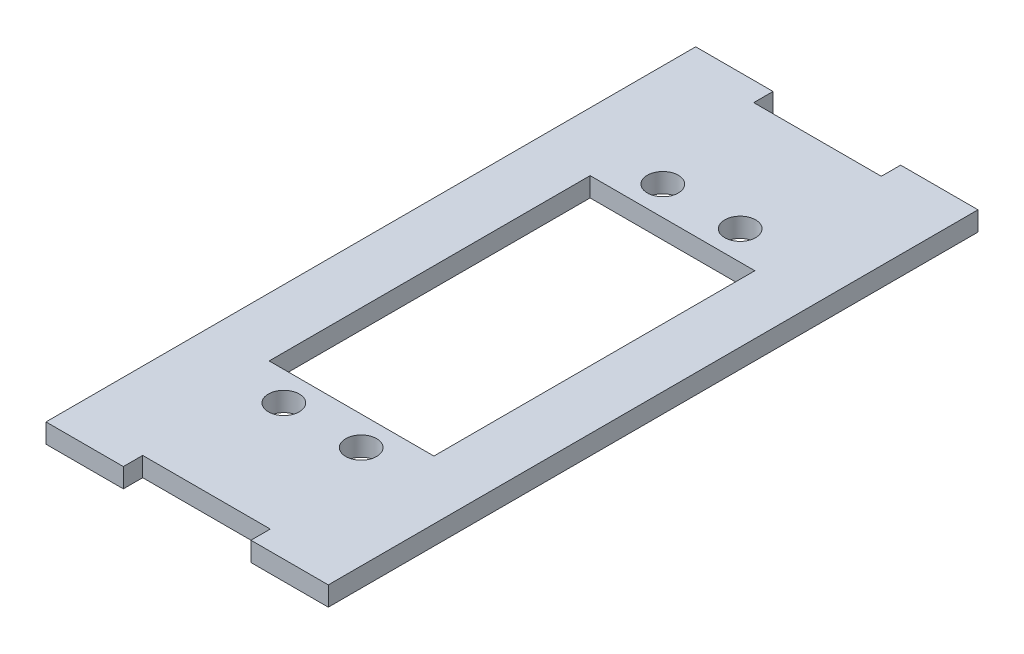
ISO-10303-21;
HEADER;
FILE_DESCRIPTION(('STEP AP214'),'2;1');
FILE_NAME('part.step','',(''),(''),'','','');
FILE_SCHEMA(('AUTOMOTIVE_DESIGN { 1 0 10303 214 1 1 1 1 }'));
ENDSEC;
DATA;
#1=APPLICATION_CONTEXT('core data for automotive mechanical design processes');
#2=APPLICATION_PROTOCOL_DEFINITION('international standard','automotive_design',2000,#1);
#3=PRODUCT_CONTEXT('',#1,'mechanical');
#4=PRODUCT('Part','Part','',(#3));
#5=PRODUCT_RELATED_PRODUCT_CATEGORY('part','',(#4));
#6=PRODUCT_DEFINITION_FORMATION('','',#4);
#7=PRODUCT_DEFINITION_CONTEXT('part definition',#1,'design');
#8=PRODUCT_DEFINITION('design','',#6,#7);
#9=PRODUCT_DEFINITION_SHAPE('','',#8);
#10=(LENGTH_UNIT() NAMED_UNIT(*) SI_UNIT(.MILLI.,.METRE.));
#11=(NAMED_UNIT(*) PLANE_ANGLE_UNIT() SI_UNIT($,.RADIAN.));
#12=(NAMED_UNIT(*) SI_UNIT($,.STERADIAN.) SOLID_ANGLE_UNIT());
#13=UNCERTAINTY_MEASURE_WITH_UNIT(LENGTH_MEASURE(1.E-05),#10,'distance_accuracy_value','');
#14=(GEOMETRIC_REPRESENTATION_CONTEXT(3) GLOBAL_UNCERTAINTY_ASSIGNED_CONTEXT((#13)) GLOBAL_UNIT_ASSIGNED_CONTEXT((#10,
#11,#12)) REPRESENTATION_CONTEXT('',''));
#15=CARTESIAN_POINT('',(0.,0.,0.));
#16=DIRECTION('',(0.,0.,1.));
#17=DIRECTION('',(1.,0.,0.));
#18=AXIS2_PLACEMENT_3D('',#15,#16,#17);
#19=CARTESIAN_POINT('',(0.,-2.5,0.));
#20=DIRECTION('',(0.,-1.,0.));
#21=DIRECTION('',(0.,0.,-1.));
#22=AXIS2_PLACEMENT_3D('',#19,#20,#21);
#23=PLANE('',#22);
#24=CARTESIAN_POINT('',(-5.,-2.50000000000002,34.5));
#25=DIRECTION('',(0.,-1.,0.));
#26=DIRECTION('',(0.,0.,-1.));
#27=AXIS2_PLACEMENT_3D('',#24,#25,#26);
#28=CIRCLE('',#27,2.0000000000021);
#29=CARTESIAN_POINT('',(-5.,-2.50000000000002,32.4999999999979));
#30=VERTEX_POINT('',#29);
#31=EDGE_CURVE('E570',#30,#30,#28,.T.);
#32=ORIENTED_EDGE('',*,*,#31,.F.);
#33=EDGE_LOOP('',(#32));
#34=FACE_BOUND('',#33,.T.);
#35=CARTESIAN_POINT('',(5.,-2.49999999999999,-14.5));
#36=DIRECTION('',(0.,-1.,0.));
#37=DIRECTION('',(0.,0.,-1.));
#38=AXIS2_PLACEMENT_3D('',#35,#36,#37);
#39=CIRCLE('',#38,2.);
#40=CARTESIAN_POINT('',(5.,-2.49999999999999,-16.5));
#41=VERTEX_POINT('',#40);
#42=EDGE_CURVE('E176',#41,#41,#39,.T.);
#43=ORIENTED_EDGE('',*,*,#42,.F.);
#44=EDGE_LOOP('',(#43));
#45=FACE_BOUND('',#44,.T.);
#46=DIRECTION('',(0.,0.,-1.));
#47=VECTOR('',#46,1.);
#48=CARTESIAN_POINT('',(-18.249101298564,-2.50000000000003,51.99999999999));
#49=LINE('',#48,#47);
#50=CARTESIAN_POINT('',(-18.249101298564,-2.50000000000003,51.99999999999));
#51=VERTEX_POINT('',#50);
#52=CARTESIAN_POINT('',(-18.249101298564,-2.49999999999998,-32.));
#53=VERTEX_POINT('',#52);
#54=EDGE_CURVE('E186',#51,#53,#49,.T.);
#55=ORIENTED_EDGE('',*,*,#54,.T.);
#56=DIRECTION('',(1.,0.,0.));
#57=VECTOR('',#56,1.);
#58=CARTESIAN_POINT('',(-18.249101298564,-2.49999999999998,-32.));
#59=LINE('',#58,#57);
#60=CARTESIAN_POINT('',(-8.249101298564,-2.49999999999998,-32.));
#61=VERTEX_POINT('',#60);
#62=EDGE_CURVE('E189',#53,#61,#59,.T.);
#63=ORIENTED_EDGE('',*,*,#62,.T.);
#64=DIRECTION('',(0.,0.,1.));
#65=VECTOR('',#64,1.);
#66=CARTESIAN_POINT('',(-8.249101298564,-2.49999999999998,-32.));
#67=LINE('',#66,#65);
#68=CARTESIAN_POINT('',(-8.249101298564,-2.49999999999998,-29.5));
#69=VERTEX_POINT('',#68);
#70=EDGE_CURVE('E192',#61,#69,#67,.T.);
#71=ORIENTED_EDGE('',*,*,#70,.T.);
#72=DIRECTION('',(1.,0.,0.));
#73=VECTOR('',#72,1.);
#74=CARTESIAN_POINT('',(-8.249101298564,-2.49999999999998,-29.5));
#75=LINE('',#74,#73);
#76=CARTESIAN_POINT('',(8.24910129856,-2.49999999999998,-29.5));
#77=VERTEX_POINT('',#76);
#78=EDGE_CURVE('E194',#69,#77,#75,.T.);
#79=ORIENTED_EDGE('',*,*,#78,.T.);
#80=DIRECTION('',(0.,0.,-1.));
#81=VECTOR('',#80,1.);
#82=CARTESIAN_POINT('',(8.24910129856,-2.49999999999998,-32.));
#83=LINE('',#82,#81);
#84=CARTESIAN_POINT('',(8.24910129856,-2.49999999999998,-32.));
#85=VERTEX_POINT('',#84);
#86=EDGE_CURVE('E196',#77,#85,#83,.T.);
#87=ORIENTED_EDGE('',*,*,#86,.T.);
#88=DIRECTION('',(1.,0.,0.));
#89=VECTOR('',#88,1.);
#90=CARTESIAN_POINT('',(8.24910129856,-2.49999999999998,-32.));
#91=LINE('',#90,#89);
#92=CARTESIAN_POINT('',(18.24910129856,-2.49999999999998,-32.));
#93=VERTEX_POINT('',#92);
#94=EDGE_CURVE('E198',#85,#93,#91,.T.);
#95=ORIENTED_EDGE('',*,*,#94,.T.);
#96=DIRECTION('',(0.,0.,1.));
#97=VECTOR('',#96,1.);
#98=CARTESIAN_POINT('',(18.24910129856,-2.50000000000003,51.99999999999));
#99=LINE('',#98,#97);
#100=CARTESIAN_POINT('',(18.24910129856,-2.50000000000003,51.99999999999));
#101=VERTEX_POINT('',#100);
#102=EDGE_CURVE('E200',#93,#101,#99,.T.);
#103=ORIENTED_EDGE('',*,*,#102,.T.);
#104=DIRECTION('',(-1.,0.,0.));
#105=VECTOR('',#104,1.);
#106=CARTESIAN_POINT('',(8.24910129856,-2.50000000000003,51.99999999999));
#107=LINE('',#106,#105);
#108=CARTESIAN_POINT('',(8.24910129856,-2.50000000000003,51.99999999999));
#109=VERTEX_POINT('',#108);
#110=EDGE_CURVE('E202',#101,#109,#107,.T.);
#111=ORIENTED_EDGE('',*,*,#110,.T.);
#112=DIRECTION('',(0.,0.,-1.));
#113=VECTOR('',#112,1.);
#114=CARTESIAN_POINT('',(8.24910129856,-2.50000000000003,51.99999999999));
#115=LINE('',#114,#113);
#116=CARTESIAN_POINT('',(8.24910129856,-2.50000000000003,49.49999999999));
#117=VERTEX_POINT('',#116);
#118=EDGE_CURVE('E204',#109,#117,#115,.T.);
#119=ORIENTED_EDGE('',*,*,#118,.T.);
#120=DIRECTION('',(-1.,0.,0.));
#121=VECTOR('',#120,1.);
#122=CARTESIAN_POINT('',(-8.249101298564,-2.50000000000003,49.49999999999));
#123=LINE('',#122,#121);
#124=CARTESIAN_POINT('',(-8.249101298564,-2.50000000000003,49.49999999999));
#125=VERTEX_POINT('',#124);
#126=EDGE_CURVE('E206',#117,#125,#123,.T.);
#127=ORIENTED_EDGE('',*,*,#126,.T.);
#128=DIRECTION('',(0.,0.,1.));
#129=VECTOR('',#128,1.);
#130=CARTESIAN_POINT('',(-8.249101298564,-2.50000000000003,51.99999999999));
#131=LINE('',#130,#129);
#132=CARTESIAN_POINT('',(-8.249101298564,-2.50000000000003,51.99999999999));
#133=VERTEX_POINT('',#132);
#134=EDGE_CURVE('E208',#125,#133,#131,.T.);
#135=ORIENTED_EDGE('',*,*,#134,.T.);
#136=DIRECTION('',(-1.,0.,0.));
#137=VECTOR('',#136,1.);
#138=CARTESIAN_POINT('',(-18.249101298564,-2.50000000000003,51.99999999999));
#139=LINE('',#138,#137);
#140=EDGE_CURVE('E210',#133,#51,#139,.T.);
#141=ORIENTED_EDGE('',*,*,#140,.T.);
#142=EDGE_LOOP('',(#55,#63,#71,#79,#87,#95,#103,#111,#119,#127,#135,#141));
#143=FACE_BOUND('',#142,.T.);
#144=DIRECTION('',(1.,0.,0.));
#145=VECTOR('',#144,1.);
#146=CARTESIAN_POINT('',(-10.649101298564,-2.49999999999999,-10.749101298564));
#147=LINE('',#146,#145);
#148=CARTESIAN_POINT('',(-10.649101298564,-2.49999999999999,-10.749101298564));
#149=VERTEX_POINT('',#148);
#150=CARTESIAN_POINT('',(10.64910129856,-2.49999999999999,-10.749101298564));
#151=VERTEX_POINT('',#150);
#152=EDGE_CURVE('E155',#149,#151,#147,.T.);
#153=ORIENTED_EDGE('',*,*,#152,.F.);
#154=DIRECTION('',(0.,0.,-1.));
#155=VECTOR('',#154,1.);
#156=CARTESIAN_POINT('',(-10.649101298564,-2.50000000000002,30.74910129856));
#157=LINE('',#156,#155);
#158=CARTESIAN_POINT('',(-10.649101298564,-2.50000000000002,30.74910129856));
#159=VERTEX_POINT('',#158);
#160=EDGE_CURVE('E147',#159,#149,#157,.T.);
#161=ORIENTED_EDGE('',*,*,#160,.F.);
#162=DIRECTION('',(-1.,0.,0.));
#163=VECTOR('',#162,1.);
#164=CARTESIAN_POINT('',(-10.649101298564,-2.50000000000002,30.74910129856));
#165=LINE('',#164,#163);
#166=CARTESIAN_POINT('',(10.64910129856,-2.50000000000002,30.74910129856));
#167=VERTEX_POINT('',#166);
#168=EDGE_CURVE('E170',#167,#159,#165,.T.);
#169=ORIENTED_EDGE('',*,*,#168,.F.);
#170=DIRECTION('',(0.,0.,1.));
#171=VECTOR('',#170,1.);
#172=CARTESIAN_POINT('',(10.64910129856,-2.50000000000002,30.74910129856));
#173=LINE('',#172,#171);
#174=EDGE_CURVE('E168',#151,#167,#173,.T.);
#175=ORIENTED_EDGE('',*,*,#174,.F.);
#176=EDGE_LOOP('',(#153,#161,#169,#175));
#177=FACE_BOUND('',#176,.T.);
#178=CARTESIAN_POINT('',(-5.,-2.49999999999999,-14.5));
#179=DIRECTION('',(0.,-1.,0.));
#180=DIRECTION('',(0.,0.,-1.));
#181=AXIS2_PLACEMENT_3D('',#178,#179,#180);
#182=CIRCLE('',#181,2.0000000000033);
#183=CARTESIAN_POINT('',(-5.,-2.49999999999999,-16.5000000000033));
#184=VERTEX_POINT('',#183);
#185=EDGE_CURVE('E576',#184,#184,#182,.T.);
#186=ORIENTED_EDGE('',*,*,#185,.F.);
#187=EDGE_LOOP('',(#186));
#188=FACE_BOUND('',#187,.T.);
#189=CARTESIAN_POINT('',(5.,-2.50000000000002,34.5));
#190=DIRECTION('',(0.,-1.,0.));
#191=DIRECTION('',(0.,0.,-1.));
#192=AXIS2_PLACEMENT_3D('',#189,#190,#191);
#193=CIRCLE('',#192,2.);
#194=CARTESIAN_POINT('',(5.,-2.50000000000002,32.5));
#195=VERTEX_POINT('',#194);
#196=EDGE_CURVE('E561',#195,#195,#193,.T.);
#197=ORIENTED_EDGE('',*,*,#196,.F.);
#198=EDGE_LOOP('',(#197));
#199=FACE_BOUND('',#198,.T.);
#200=ADVANCED_FACE('F34',(#34,#45,#143,#177,#188,#199),#23,.T.);
#201=CARTESIAN_POINT('',(0.,0.,0.));
#202=DIRECTION('',(0.,-1.,0.));
#203=DIRECTION('',(0.,0.,-1.));
#204=AXIS2_PLACEMENT_3D('',#201,#202,#203);
#205=PLANE('',#204);
#206=DIRECTION('',(0.,0.,-1.));
#207=VECTOR('',#206,1.);
#208=CARTESIAN_POINT('',(-18.249101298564,0.,51.99999999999));
#209=LINE('',#208,#207);
#210=CARTESIAN_POINT('',(-18.249101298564,0.,51.99999999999));
#211=VERTEX_POINT('',#210);
#212=CARTESIAN_POINT('',(-18.249101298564,0.,-32.));
#213=VERTEX_POINT('',#212);
#214=EDGE_CURVE('E163',#211,#213,#209,.T.);
#215=ORIENTED_EDGE('',*,*,#214,.F.);
#216=DIRECTION('',(-1.,0.,0.));
#217=VECTOR('',#216,1.);
#218=CARTESIAN_POINT('',(-18.249101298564,0.,51.99999999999));
#219=LINE('',#218,#217);
#220=CARTESIAN_POINT('',(-8.249101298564,0.,51.99999999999));
#221=VERTEX_POINT('',#220);
#222=EDGE_CURVE('E190',#221,#211,#219,.T.);
#223=ORIENTED_EDGE('',*,*,#222,.F.);
#224=DIRECTION('',(0.,0.,1.));
#225=VECTOR('',#224,1.);
#226=CARTESIAN_POINT('',(-8.249101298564,0.,51.99999999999));
#227=LINE('',#226,#225);
#228=CARTESIAN_POINT('',(-8.249101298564,0.,49.49999999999));
#229=VERTEX_POINT('',#228);
#230=EDGE_CURVE('E233',#229,#221,#227,.T.);
#231=ORIENTED_EDGE('',*,*,#230,.F.);
#232=DIRECTION('',(-1.,0.,0.));
#233=VECTOR('',#232,1.);
#234=CARTESIAN_POINT('',(-8.249101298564,0.,49.49999999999));
#235=LINE('',#234,#233);
#236=CARTESIAN_POINT('',(8.24910129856,0.,49.49999999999));
#237=VERTEX_POINT('',#236);
#238=EDGE_CURVE('E231',#237,#229,#235,.T.);
#239=ORIENTED_EDGE('',*,*,#238,.F.);
#240=DIRECTION('',(0.,0.,-1.));
#241=VECTOR('',#240,1.);
#242=CARTESIAN_POINT('',(8.24910129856,0.,51.99999999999));
#243=LINE('',#242,#241);
#244=CARTESIAN_POINT('',(8.24910129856,0.,51.99999999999));
#245=VERTEX_POINT('',#244);
#246=EDGE_CURVE('E229',#245,#237,#243,.T.);
#247=ORIENTED_EDGE('',*,*,#246,.F.);
#248=DIRECTION('',(-1.,0.,0.));
#249=VECTOR('',#248,1.);
#250=CARTESIAN_POINT('',(8.24910129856,0.,51.99999999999));
#251=LINE('',#250,#249);
#252=CARTESIAN_POINT('',(18.24910129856,0.,51.99999999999));
#253=VERTEX_POINT('',#252);
#254=EDGE_CURVE('E227',#253,#245,#251,.T.);
#255=ORIENTED_EDGE('',*,*,#254,.F.);
#256=DIRECTION('',(0.,0.,1.));
#257=VECTOR('',#256,1.);
#258=CARTESIAN_POINT('',(18.24910129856,0.,51.99999999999));
#259=LINE('',#258,#257);
#260=CARTESIAN_POINT('',(18.24910129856,0.,-32.));
#261=VERTEX_POINT('',#260);
#262=EDGE_CURVE('E225',#261,#253,#259,.T.);
#263=ORIENTED_EDGE('',*,*,#262,.F.);
#264=DIRECTION('',(1.,0.,0.));
#265=VECTOR('',#264,1.);
#266=CARTESIAN_POINT('',(8.24910129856,0.,-32.));
#267=LINE('',#266,#265);
#268=CARTESIAN_POINT('',(8.24910129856,0.,-32.));
#269=VERTEX_POINT('',#268);
#270=EDGE_CURVE('E223',#269,#261,#267,.T.);
#271=ORIENTED_EDGE('',*,*,#270,.F.);
#272=DIRECTION('',(0.,0.,-1.));
#273=VECTOR('',#272,1.);
#274=CARTESIAN_POINT('',(8.24910129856,0.,-32.));
#275=LINE('',#274,#273);
#276=CARTESIAN_POINT('',(8.24910129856,0.,-29.5));
#277=VERTEX_POINT('',#276);
#278=EDGE_CURVE('E221',#277,#269,#275,.T.);
#279=ORIENTED_EDGE('',*,*,#278,.F.);
#280=DIRECTION('',(1.,0.,0.));
#281=VECTOR('',#280,1.);
#282=CARTESIAN_POINT('',(-8.249101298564,0.,-29.5));
#283=LINE('',#282,#281);
#284=CARTESIAN_POINT('',(-8.249101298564,0.,-29.5));
#285=VERTEX_POINT('',#284);
#286=EDGE_CURVE('E219',#285,#277,#283,.T.);
#287=ORIENTED_EDGE('',*,*,#286,.F.);
#288=DIRECTION('',(0.,0.,1.));
#289=VECTOR('',#288,1.);
#290=CARTESIAN_POINT('',(-8.249101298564,0.,-32.));
#291=LINE('',#290,#289);
#292=CARTESIAN_POINT('',(-8.249101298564,0.,-32.));
#293=VERTEX_POINT('',#292);
#294=EDGE_CURVE('E217',#293,#285,#291,.T.);
#295=ORIENTED_EDGE('',*,*,#294,.F.);
#296=DIRECTION('',(1.,0.,0.));
#297=VECTOR('',#296,1.);
#298=CARTESIAN_POINT('',(-18.249101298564,0.,-32.));
#299=LINE('',#298,#297);
#300=EDGE_CURVE('E215',#213,#293,#299,.T.);
#301=ORIENTED_EDGE('',*,*,#300,.F.);
#302=EDGE_LOOP('',(#215,#223,#231,#239,#247,#255,#263,#271,#279,#287,#295,#301));
#303=FACE_BOUND('',#302,.T.);
#304=DIRECTION('',(0.,0.,-1.));
#305=VECTOR('',#304,1.);
#306=CARTESIAN_POINT('',(-10.649101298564,0.,30.74910129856));
#307=LINE('',#306,#305);
#308=CARTESIAN_POINT('',(-10.649101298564,0.,30.74910129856));
#309=VERTEX_POINT('',#308);
#310=CARTESIAN_POINT('',(-10.649101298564,0.,-10.749101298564));
#311=VERTEX_POINT('',#310);
#312=EDGE_CURVE('E57',#309,#311,#307,.T.);
#313=ORIENTED_EDGE('',*,*,#312,.T.);
#314=DIRECTION('',(1.,0.,0.));
#315=VECTOR('',#314,1.);
#316=CARTESIAN_POINT('',(-10.649101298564,0.,-10.749101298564));
#317=LINE('',#316,#315);
#318=CARTESIAN_POINT('',(10.64910129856,0.,-10.749101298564));
#319=VERTEX_POINT('',#318);
#320=EDGE_CURVE('E162',#311,#319,#317,.T.);
#321=ORIENTED_EDGE('',*,*,#320,.T.);
#322=DIRECTION('',(0.,0.,1.));
#323=VECTOR('',#322,1.);
#324=CARTESIAN_POINT('',(10.64910129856,0.,30.74910129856));
#325=LINE('',#324,#323);
#326=CARTESIAN_POINT('',(10.64910129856,0.,30.74910129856));
#327=VERTEX_POINT('',#326);
#328=EDGE_CURVE('E178',#319,#327,#325,.T.);
#329=ORIENTED_EDGE('',*,*,#328,.T.);
#330=DIRECTION('',(-1.,0.,0.));
#331=VECTOR('',#330,1.);
#332=CARTESIAN_POINT('',(-10.649101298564,0.,30.74910129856));
#333=LINE('',#332,#331);
#334=EDGE_CURVE('E156',#327,#309,#333,.T.);
#335=ORIENTED_EDGE('',*,*,#334,.T.);
#336=EDGE_LOOP('',(#313,#321,#329,#335));
#337=FACE_BOUND('',#336,.T.);
#338=CARTESIAN_POINT('',(5.,0.,-14.5));
#339=DIRECTION('',(0.,-1.,0.));
#340=DIRECTION('',(0.,0.,-1.));
#341=AXIS2_PLACEMENT_3D('',#338,#339,#340);
#342=CIRCLE('',#341,2.);
#343=CARTESIAN_POINT('',(5.,0.,-16.5));
#344=VERTEX_POINT('',#343);
#345=EDGE_CURVE('E579',#344,#344,#342,.T.);
#346=ORIENTED_EDGE('',*,*,#345,.T.);
#347=EDGE_LOOP('',(#346));
#348=FACE_BOUND('',#347,.T.);
#349=CARTESIAN_POINT('',(-5.,0.,-14.5));
#350=DIRECTION('',(0.,-1.,0.));
#351=DIRECTION('',(0.,0.,-1.));
#352=AXIS2_PLACEMENT_3D('',#349,#350,#351);
#353=CIRCLE('',#352,2.0000000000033);
#354=CARTESIAN_POINT('',(-5.,0.,-16.5000000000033));
#355=VERTEX_POINT('',#354);
#356=EDGE_CURVE('E573',#355,#355,#353,.T.);
#357=ORIENTED_EDGE('',*,*,#356,.T.);
#358=EDGE_LOOP('',(#357));
#359=FACE_BOUND('',#358,.T.);
#360=CARTESIAN_POINT('',(-5.,0.,34.5));
#361=DIRECTION('',(0.,-1.,0.));
#362=DIRECTION('',(0.,0.,-1.));
#363=AXIS2_PLACEMENT_3D('',#360,#361,#362);
#364=CIRCLE('',#363,2.0000000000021);
#365=CARTESIAN_POINT('',(-5.,0.,32.4999999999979));
#366=VERTEX_POINT('',#365);
#367=EDGE_CURVE('E567',#366,#366,#364,.T.);
#368=ORIENTED_EDGE('',*,*,#367,.T.);
#369=EDGE_LOOP('',(#368));
#370=FACE_BOUND('',#369,.T.);
#371=CARTESIAN_POINT('',(5.,0.,34.5));
#372=DIRECTION('',(0.,-1.,0.));
#373=DIRECTION('',(0.,0.,-1.));
#374=AXIS2_PLACEMENT_3D('',#371,#372,#373);
#375=CIRCLE('',#374,2.);
#376=CARTESIAN_POINT('',(5.,0.,32.5));
#377=VERTEX_POINT('',#376);
#378=EDGE_CURVE('E564',#377,#377,#375,.T.);
#379=ORIENTED_EDGE('',*,*,#378,.T.);
#380=EDGE_LOOP('',(#379));
#381=FACE_BOUND('',#380,.T.);
#382=ADVANCED_FACE('F275',(#303,#337,#348,#359,#370,#381),#205,.F.);
#383=CARTESIAN_POINT('',(-18.249101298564,-2.50000000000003,51.99999999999));
#384=DIRECTION('',(1.,0.,0.));
#385=DIRECTION('',(0.,0.,-1.));
#386=AXIS2_PLACEMENT_3D('',#383,#384,#385);
#387=PLANE('',#386);
#388=ORIENTED_EDGE('',*,*,#214,.T.);
#389=DIRECTION('',(0.,1.,0.));
#390=VECTOR('',#389,1.);
#391=CARTESIAN_POINT('',(-18.249101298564,-2.49999999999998,-32.));
#392=LINE('',#391,#390);
#393=EDGE_CURVE('E11',#53,#213,#392,.T.);
#394=ORIENTED_EDGE('',*,*,#393,.F.);
#395=ORIENTED_EDGE('',*,*,#54,.F.);
#396=DIRECTION('',(0.,1.,0.));
#397=VECTOR('',#396,1.);
#398=CARTESIAN_POINT('',(-18.249101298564,-2.50000000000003,51.99999999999));
#399=LINE('',#398,#397);
#400=EDGE_CURVE('E212',#51,#211,#399,.T.);
#401=ORIENTED_EDGE('',*,*,#400,.T.);
#402=EDGE_LOOP('',(#388,#394,#395,#401));
#403=FACE_BOUND('',#402,.T.);
#404=ADVANCED_FACE('F36',(#403),#387,.F.);
#405=CARTESIAN_POINT('',(-18.249101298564,-2.49999999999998,-32.));
#406=DIRECTION('',(0.,0.,1.));
#407=DIRECTION('',(1.,0.,0.));
#408=AXIS2_PLACEMENT_3D('',#405,#406,#407);
#409=PLANE('',#408);
#410=ORIENTED_EDGE('',*,*,#300,.T.);
#411=DIRECTION('',(0.,1.,0.));
#412=VECTOR('',#411,1.);
#413=CARTESIAN_POINT('',(-8.249101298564,-2.49999999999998,-32.));
#414=LINE('',#413,#412);
#415=EDGE_CURVE('E42',#61,#293,#414,.T.);
#416=ORIENTED_EDGE('',*,*,#415,.F.);
#417=ORIENTED_EDGE('',*,*,#62,.F.);
#418=ORIENTED_EDGE('',*,*,#393,.T.);
#419=EDGE_LOOP('',(#410,#416,#417,#418));
#420=FACE_BOUND('',#419,.T.);
#421=ADVANCED_FACE('F292',(#420),#409,.F.);
#422=CARTESIAN_POINT('',(-8.249101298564,-2.49999999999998,-32.));
#423=DIRECTION('',(-1.,0.,0.));
#424=DIRECTION('',(0.,0.,1.));
#425=AXIS2_PLACEMENT_3D('',#422,#423,#424);
#426=PLANE('',#425);
#427=ORIENTED_EDGE('',*,*,#294,.T.);
#428=DIRECTION('',(0.,1.,0.));
#429=VECTOR('',#428,1.);
#430=CARTESIAN_POINT('',(-8.249101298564,-2.49999999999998,-29.5));
#431=LINE('',#430,#429);
#432=EDGE_CURVE('E262',#69,#285,#431,.T.);
#433=ORIENTED_EDGE('',*,*,#432,.F.);
#434=ORIENTED_EDGE('',*,*,#70,.F.);
#435=ORIENTED_EDGE('',*,*,#415,.T.);
#436=EDGE_LOOP('',(#427,#433,#434,#435));
#437=FACE_BOUND('',#436,.T.);
#438=ADVANCED_FACE('F269',(#437),#426,.F.);
#439=CARTESIAN_POINT('',(-8.249101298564,-2.49999999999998,-29.5));
#440=DIRECTION('',(0.,0.,1.));
#441=DIRECTION('',(0.,-1.,0.));
#442=AXIS2_PLACEMENT_3D('',#439,#440,#441);
#443=PLANE('',#442);
#444=ORIENTED_EDGE('',*,*,#286,.T.);
#445=DIRECTION('',(0.,1.,0.));
#446=VECTOR('',#445,1.);
#447=CARTESIAN_POINT('',(8.24910129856,-2.49999999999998,-29.5));
#448=LINE('',#447,#446);
#449=EDGE_CURVE('E259',#77,#277,#448,.T.);
#450=ORIENTED_EDGE('',*,*,#449,.F.);
#451=ORIENTED_EDGE('',*,*,#78,.F.);
#452=ORIENTED_EDGE('',*,*,#432,.T.);
#453=EDGE_LOOP('',(#444,#450,#451,#452));
#454=FACE_BOUND('',#453,.T.);
#455=ADVANCED_FACE('F281',(#454),#443,.F.);
#456=CARTESIAN_POINT('',(8.24910129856,-2.49999999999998,-32.));
#457=DIRECTION('',(1.,0.,0.));
#458=DIRECTION('',(0.,0.,-1.));
#459=AXIS2_PLACEMENT_3D('',#456,#457,#458);
#460=PLANE('',#459);
#461=ORIENTED_EDGE('',*,*,#278,.T.);
#462=DIRECTION('',(0.,1.,0.));
#463=VECTOR('',#462,1.);
#464=CARTESIAN_POINT('',(8.24910129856,-2.49999999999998,-32.));
#465=LINE('',#464,#463);
#466=EDGE_CURVE('E256',#85,#269,#465,.T.);
#467=ORIENTED_EDGE('',*,*,#466,.F.);
#468=ORIENTED_EDGE('',*,*,#86,.F.);
#469=ORIENTED_EDGE('',*,*,#449,.T.);
#470=EDGE_LOOP('',(#461,#467,#468,#469));
#471=FACE_BOUND('',#470,.T.);
#472=ADVANCED_FACE('F285',(#471),#460,.F.);
#473=CARTESIAN_POINT('',(8.24910129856,-2.49999999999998,-32.));
#474=DIRECTION('',(0.,0.,1.));
#475=DIRECTION('',(1.,0.,0.));
#476=AXIS2_PLACEMENT_3D('',#473,#474,#475);
#477=PLANE('',#476);
#478=ORIENTED_EDGE('',*,*,#270,.T.);
#479=DIRECTION('',(0.,1.,0.));
#480=VECTOR('',#479,1.);
#481=CARTESIAN_POINT('',(18.24910129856,-2.49999999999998,-32.));
#482=LINE('',#481,#480);
#483=EDGE_CURVE('E253',#93,#261,#482,.T.);
#484=ORIENTED_EDGE('',*,*,#483,.F.);
#485=ORIENTED_EDGE('',*,*,#94,.F.);
#486=ORIENTED_EDGE('',*,*,#466,.T.);
#487=EDGE_LOOP('',(#478,#484,#485,#486));
#488=FACE_BOUND('',#487,.T.);
#489=ADVANCED_FACE('F325',(#488),#477,.F.);
#490=CARTESIAN_POINT('',(18.24910129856,-2.50000000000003,51.99999999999));
#491=DIRECTION('',(-1.,0.,0.));
#492=DIRECTION('',(0.,0.,1.));
#493=AXIS2_PLACEMENT_3D('',#490,#491,#492);
#494=PLANE('',#493);
#495=ORIENTED_EDGE('',*,*,#262,.T.);
#496=DIRECTION('',(0.,1.,0.));
#497=VECTOR('',#496,1.);
#498=CARTESIAN_POINT('',(18.24910129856,-2.50000000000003,51.99999999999));
#499=LINE('',#498,#497);
#500=EDGE_CURVE('E250',#101,#253,#499,.T.);
#501=ORIENTED_EDGE('',*,*,#500,.F.);
#502=ORIENTED_EDGE('',*,*,#102,.F.);
#503=ORIENTED_EDGE('',*,*,#483,.T.);
#504=EDGE_LOOP('',(#495,#501,#502,#503));
#505=FACE_BOUND('',#504,.T.);
#506=ADVANCED_FACE('F323',(#505),#494,.F.);
#507=CARTESIAN_POINT('',(8.24910129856,-2.50000000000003,51.99999999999));
#508=DIRECTION('',(0.,0.,-1.));
#509=DIRECTION('',(0.,1.,0.));
#510=AXIS2_PLACEMENT_3D('',#507,#508,#509);
#511=PLANE('',#510);
#512=ORIENTED_EDGE('',*,*,#254,.T.);
#513=DIRECTION('',(0.,1.,0.));
#514=VECTOR('',#513,1.);
#515=CARTESIAN_POINT('',(8.24910129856,-2.50000000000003,51.99999999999));
#516=LINE('',#515,#514);
#517=EDGE_CURVE('E247',#109,#245,#516,.T.);
#518=ORIENTED_EDGE('',*,*,#517,.F.);
#519=ORIENTED_EDGE('',*,*,#110,.F.);
#520=ORIENTED_EDGE('',*,*,#500,.T.);
#521=EDGE_LOOP('',(#512,#518,#519,#520));
#522=FACE_BOUND('',#521,.T.);
#523=ADVANCED_FACE('F319',(#522),#511,.F.);
#524=CARTESIAN_POINT('',(8.24910129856,-2.50000000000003,51.99999999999));
#525=DIRECTION('',(1.,0.,0.));
#526=DIRECTION('',(0.,0.,-1.));
#527=AXIS2_PLACEMENT_3D('',#524,#525,#526);
#528=PLANE('',#527);
#529=ORIENTED_EDGE('',*,*,#246,.T.);
#530=DIRECTION('',(0.,1.,0.));
#531=VECTOR('',#530,1.);
#532=CARTESIAN_POINT('',(8.24910129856,-2.50000000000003,49.49999999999));
#533=LINE('',#532,#531);
#534=EDGE_CURVE('E244',#117,#237,#533,.T.);
#535=ORIENTED_EDGE('',*,*,#534,.F.);
#536=ORIENTED_EDGE('',*,*,#118,.F.);
#537=ORIENTED_EDGE('',*,*,#517,.T.);
#538=EDGE_LOOP('',(#529,#535,#536,#537));
#539=FACE_BOUND('',#538,.T.);
#540=ADVANCED_FACE('F314',(#539),#528,.F.);
#541=CARTESIAN_POINT('',(-8.249101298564,-2.50000000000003,49.49999999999));
#542=DIRECTION('',(0.,0.,-1.));
#543=DIRECTION('',(-1.,0.,0.));
#544=AXIS2_PLACEMENT_3D('',#541,#542,#543);
#545=PLANE('',#544);
#546=ORIENTED_EDGE('',*,*,#238,.T.);
#547=DIRECTION('',(0.,1.,0.));
#548=VECTOR('',#547,1.);
#549=CARTESIAN_POINT('',(-8.249101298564,-2.50000000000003,49.49999999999));
#550=LINE('',#549,#548);
#551=EDGE_CURVE('E241',#125,#229,#550,.T.);
#552=ORIENTED_EDGE('',*,*,#551,.F.);
#553=ORIENTED_EDGE('',*,*,#126,.F.);
#554=ORIENTED_EDGE('',*,*,#534,.T.);
#555=EDGE_LOOP('',(#546,#552,#553,#554));
#556=FACE_BOUND('',#555,.T.);
#557=ADVANCED_FACE('F308',(#556),#545,.F.);
#558=CARTESIAN_POINT('',(-8.249101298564,-2.50000000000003,51.99999999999));
#559=DIRECTION('',(-1.,0.,0.));
#560=DIRECTION('',(0.,0.,1.));
#561=AXIS2_PLACEMENT_3D('',#558,#559,#560);
#562=PLANE('',#561);
#563=ORIENTED_EDGE('',*,*,#230,.T.);
#564=DIRECTION('',(0.,1.,0.));
#565=VECTOR('',#564,1.);
#566=CARTESIAN_POINT('',(-8.249101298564,-2.50000000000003,51.99999999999));
#567=LINE('',#566,#565);
#568=EDGE_CURVE('E238',#133,#221,#567,.T.);
#569=ORIENTED_EDGE('',*,*,#568,.F.);
#570=ORIENTED_EDGE('',*,*,#134,.F.);
#571=ORIENTED_EDGE('',*,*,#551,.T.);
#572=EDGE_LOOP('',(#563,#569,#570,#571));
#573=FACE_BOUND('',#572,.T.);
#574=ADVANCED_FACE('F304',(#573),#562,.F.);
#575=CARTESIAN_POINT('',(-18.249101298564,-2.50000000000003,51.99999999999));
#576=DIRECTION('',(0.,0.,-1.));
#577=DIRECTION('',(0.,1.,0.));
#578=AXIS2_PLACEMENT_3D('',#575,#576,#577);
#579=PLANE('',#578);
#580=ORIENTED_EDGE('',*,*,#222,.T.);
#581=ORIENTED_EDGE('',*,*,#400,.F.);
#582=ORIENTED_EDGE('',*,*,#140,.F.);
#583=ORIENTED_EDGE('',*,*,#568,.T.);
#584=EDGE_LOOP('',(#580,#581,#582,#583));
#585=FACE_BOUND('',#584,.T.);
#586=ADVANCED_FACE('F299',(#585),#579,.F.);
#587=CARTESIAN_POINT('',(-10.649101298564,-2.50000000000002,30.74910129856));
#588=DIRECTION('',(1.,0.,0.));
#589=DIRECTION('',(0.,0.,-1.));
#590=AXIS2_PLACEMENT_3D('',#587,#588,#589);
#591=PLANE('',#590);
#592=ORIENTED_EDGE('',*,*,#312,.F.);
#593=DIRECTION('',(0.,1.,0.));
#594=VECTOR('',#593,1.);
#595=CARTESIAN_POINT('',(-10.649101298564,-2.50000000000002,30.74910129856));
#596=LINE('',#595,#594);
#597=EDGE_CURVE('E151',#159,#309,#596,.T.);
#598=ORIENTED_EDGE('',*,*,#597,.F.);
#599=ORIENTED_EDGE('',*,*,#160,.T.);
#600=DIRECTION('',(0.,1.,0.));
#601=VECTOR('',#600,1.);
#602=CARTESIAN_POINT('',(-10.649101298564,-2.49999999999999,-10.749101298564));
#603=LINE('',#602,#601);
#604=EDGE_CURVE('E150',#149,#311,#603,.T.);
#605=ORIENTED_EDGE('',*,*,#604,.T.);
#606=EDGE_LOOP('',(#592,#598,#599,#605));
#607=FACE_BOUND('',#606,.T.);
#608=ADVANCED_FACE('F149',(#607),#591,.T.);
#609=CARTESIAN_POINT('',(-10.649101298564,-2.49999999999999,-10.749101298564));
#610=DIRECTION('',(0.,0.,1.));
#611=DIRECTION('',(0.,-1.,0.));
#612=AXIS2_PLACEMENT_3D('',#609,#610,#611);
#613=PLANE('',#612);
#614=ORIENTED_EDGE('',*,*,#320,.F.);
#615=ORIENTED_EDGE('',*,*,#604,.F.);
#616=ORIENTED_EDGE('',*,*,#152,.T.);
#617=DIRECTION('',(0.,1.,0.));
#618=VECTOR('',#617,1.);
#619=CARTESIAN_POINT('',(10.64910129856,-2.49999999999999,-10.749101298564));
#620=LINE('',#619,#618);
#621=EDGE_CURVE('E164',#151,#319,#620,.T.);
#622=ORIENTED_EDGE('',*,*,#621,.T.);
#623=EDGE_LOOP('',(#614,#615,#616,#622));
#624=FACE_BOUND('',#623,.T.);
#625=ADVANCED_FACE('F159',(#624),#613,.T.);
#626=CARTESIAN_POINT('',(10.64910129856,-2.50000000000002,30.74910129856));
#627=DIRECTION('',(-1.,0.,0.));
#628=DIRECTION('',(0.,0.,1.));
#629=AXIS2_PLACEMENT_3D('',#626,#627,#628);
#630=PLANE('',#629);
#631=ORIENTED_EDGE('',*,*,#328,.F.);
#632=ORIENTED_EDGE('',*,*,#621,.F.);
#633=ORIENTED_EDGE('',*,*,#174,.T.);
#634=DIRECTION('',(0.,1.,0.));
#635=VECTOR('',#634,1.);
#636=CARTESIAN_POINT('',(10.64910129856,-2.50000000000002,30.74910129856));
#637=LINE('',#636,#635);
#638=EDGE_CURVE('E49',#167,#327,#637,.T.);
#639=ORIENTED_EDGE('',*,*,#638,.T.);
#640=EDGE_LOOP('',(#631,#632,#633,#639));
#641=FACE_BOUND('',#640,.T.);
#642=ADVANCED_FACE('F386',(#641),#630,.T.);
#643=CARTESIAN_POINT('',(-10.649101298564,-2.50000000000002,30.74910129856));
#644=DIRECTION('',(0.,0.,-1.));
#645=DIRECTION('',(0.,1.,0.));
#646=AXIS2_PLACEMENT_3D('',#643,#644,#645);
#647=PLANE('',#646);
#648=ORIENTED_EDGE('',*,*,#334,.F.);
#649=ORIENTED_EDGE('',*,*,#638,.F.);
#650=ORIENTED_EDGE('',*,*,#168,.T.);
#651=ORIENTED_EDGE('',*,*,#597,.T.);
#652=EDGE_LOOP('',(#648,#649,#650,#651));
#653=FACE_BOUND('',#652,.T.);
#654=ADVANCED_FACE('F392',(#653),#647,.T.);
#655=CARTESIAN_POINT('',(5.,-2.49999999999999,-14.5));
#656=DIRECTION('',(0.,1.,0.));
#657=DIRECTION('',(0.,0.,1.));
#658=AXIS2_PLACEMENT_3D('',#655,#656,#657);
#659=CYLINDRICAL_SURFACE('',#658,2.);
#660=ORIENTED_EDGE('',*,*,#42,.T.);
#661=EDGE_LOOP('',(#660));
#662=FACE_BOUND('',#661,.T.);
#663=ORIENTED_EDGE('',*,*,#345,.F.);
#664=EDGE_LOOP('',(#663));
#665=FACE_BOUND('',#664,.T.);
#666=ADVANCED_FACE('F400',(#662,#665),#659,.F.);
#667=CARTESIAN_POINT('',(-5.,-2.49999999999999,-14.5));
#668=DIRECTION('',(0.,1.,0.));
#669=DIRECTION('',(0.,0.,1.));
#670=AXIS2_PLACEMENT_3D('',#667,#668,#669);
#671=CYLINDRICAL_SURFACE('',#670,2.0000000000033);
#672=ORIENTED_EDGE('',*,*,#185,.T.);
#673=EDGE_LOOP('',(#672));
#674=FACE_BOUND('',#673,.T.);
#675=ORIENTED_EDGE('',*,*,#356,.F.);
#676=EDGE_LOOP('',(#675));
#677=FACE_BOUND('',#676,.T.);
#678=ADVANCED_FACE('F407',(#674,#677),#671,.F.);
#679=CARTESIAN_POINT('',(-5.,-2.50000000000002,34.5));
#680=DIRECTION('',(0.,1.,0.));
#681=DIRECTION('',(0.,0.,1.));
#682=AXIS2_PLACEMENT_3D('',#679,#680,#681);
#683=CYLINDRICAL_SURFACE('',#682,2.0000000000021);
#684=ORIENTED_EDGE('',*,*,#31,.T.);
#685=EDGE_LOOP('',(#684));
#686=FACE_BOUND('',#685,.T.);
#687=ORIENTED_EDGE('',*,*,#367,.F.);
#688=EDGE_LOOP('',(#687));
#689=FACE_BOUND('',#688,.T.);
#690=ADVANCED_FACE('F415',(#686,#689),#683,.F.);
#691=CARTESIAN_POINT('',(5.,-2.50000000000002,34.5));
#692=DIRECTION('',(0.,1.,0.));
#693=DIRECTION('',(0.,0.,1.));
#694=AXIS2_PLACEMENT_3D('',#691,#692,#693);
#695=CYLINDRICAL_SURFACE('',#694,2.);
#696=ORIENTED_EDGE('',*,*,#196,.T.);
#697=EDGE_LOOP('',(#696));
#698=FACE_BOUND('',#697,.T.);
#699=ORIENTED_EDGE('',*,*,#378,.F.);
#700=EDGE_LOOP('',(#699));
#701=FACE_BOUND('',#700,.T.);
#702=ADVANCED_FACE('F423',(#698,#701),#695,.F.);
#703=CLOSED_SHELL('',(#200,#382,#404,#421,#438,#455,#472,#489,#506,#523,#540,#557,#574,#586,
#608,#625,#642,#654,#666,#678,#690,#702));
#704=MANIFOLD_SOLID_BREP('B2',#703);
#705=ADVANCED_BREP_SHAPE_REPRESENTATION('',(#18,#704),#14);
#706=SHAPE_DEFINITION_REPRESENTATION(#9,#705);
ENDSEC;
END-ISO-10303-21;
